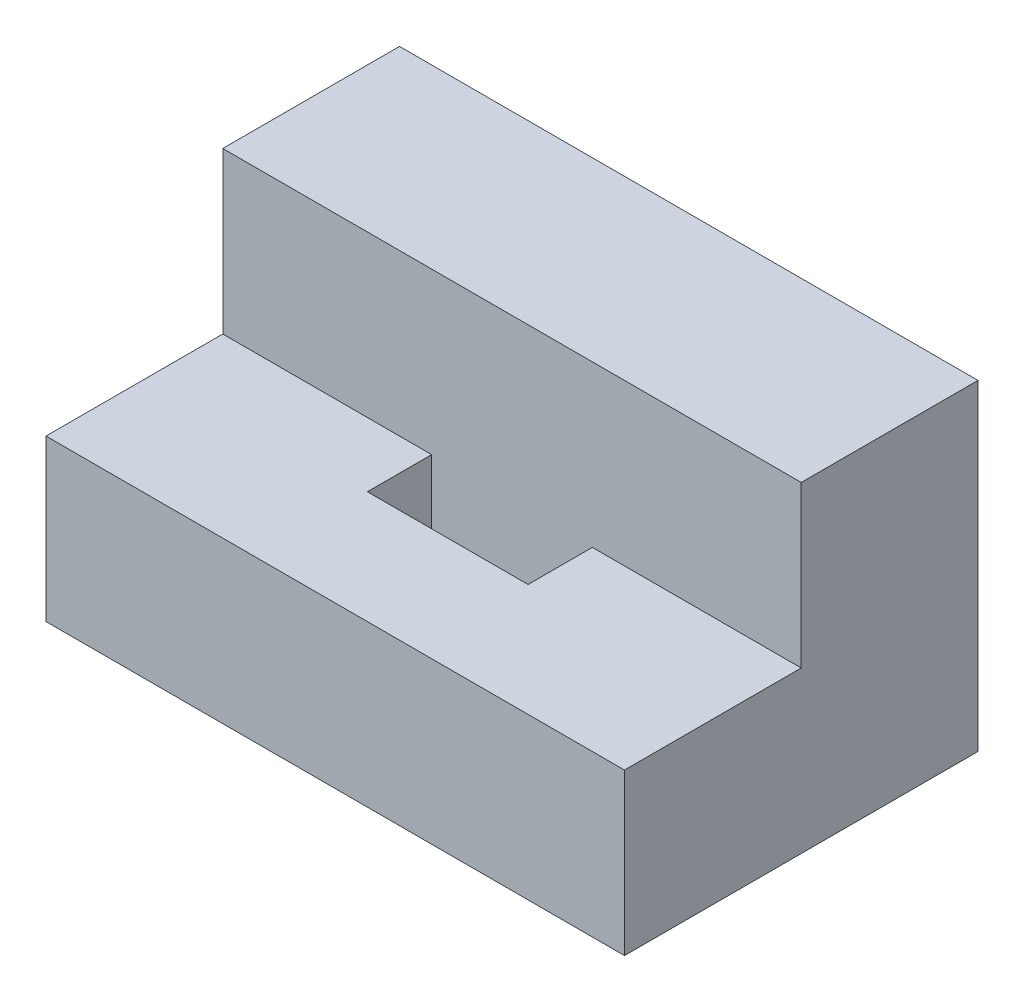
from build123d import *

# Parameters (mm, degrees)
SKETCH_1_W          = 90
SKETCH_1_H          = 55
EXTRUDE_1_DEPTH     = 25
SKETCH_2_W          = 90
SKETCH_2_H          = 27.5
EXTRUDE_2_DEPTH     = 25
SKETCH_3_W          = 25
SKETCH_3_H          = 10
CUT_EXTRUDE_1_DEPTH = 109.397416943


with BuildPart() as part:
    # Sketch 1 → Extrude 1 (new body)
    with BuildSketch(Plane(origin=(0, 0, 0), x_dir=(1, 0, 0), z_dir=(0, 1, 0))):
        with Locations((45, 27.5)):
            Rectangle(SKETCH_1_W, SKETCH_1_H)
    extrude(amount=EXTRUDE_1_DEPTH)

    # Sketch 2 → Extrude 2 (add)
    with BuildSketch(Plane(origin=(0, 25, 0), x_dir=(1, 0, 0), z_dir=(0, 1, 0))):
        with Locations((45, 41.25)):
            Rectangle(SKETCH_2_W, SKETCH_2_H)
    extrude(amount=EXTRUDE_2_DEPTH)

    # Sketch 3 → Cut-Extrude 1 (cut, through all)
    with BuildSketch(Plane(origin=(0, 25, 0), x_dir=(1, 0, 0), z_dir=(0, 1, 0))):
        with Locations((45, 22.5)):
            Rectangle(SKETCH_3_W, SKETCH_3_H)
    extrude(amount=-CUT_EXTRUDE_1_DEPTH, mode=Mode.SUBTRACT)


solid = part.part
